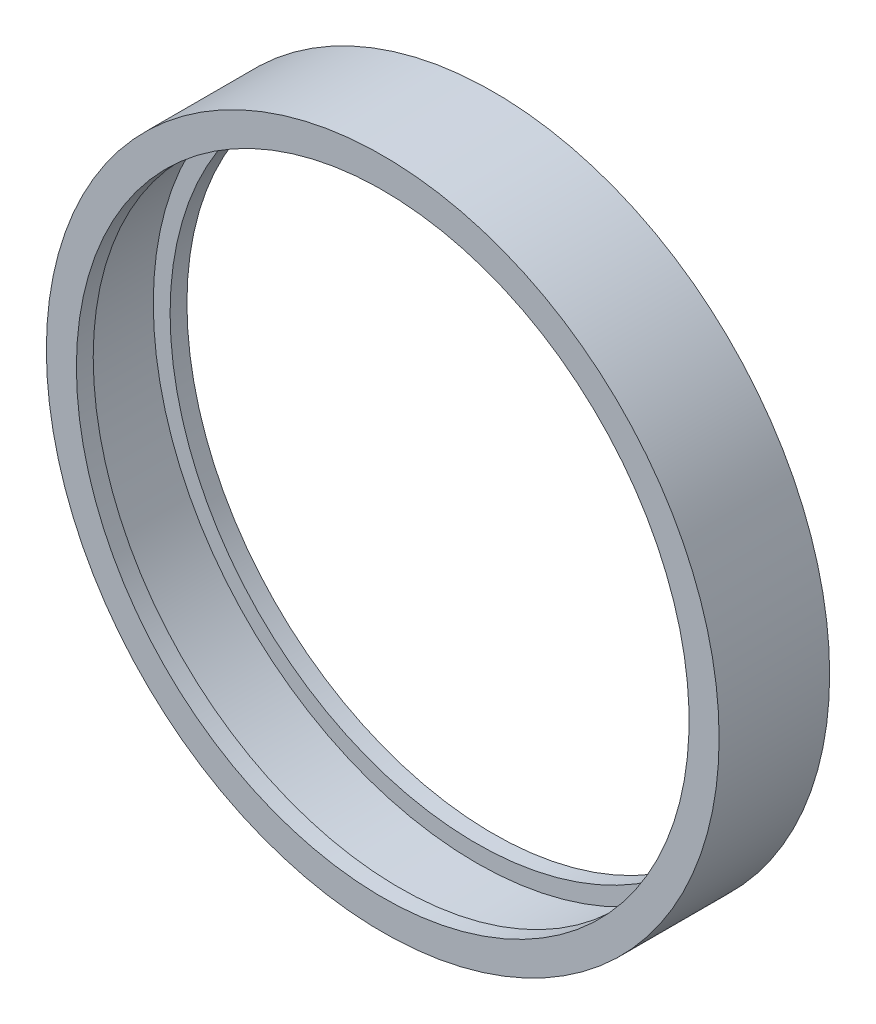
from build123d import *


with BuildPart() as part:
    # Sweep1: sweep along a path in Sketch1
    with BuildLine(Plane.XY) as sweep1_path:
        CenterArc((0, 0), 140, 0, 360)
    # Sketch2 → Sweep1 (sweep)
    with BuildSketch(Plane(origin=(-140, 0, 0), x_dir=(1, 0, 0), z_dir=(0, -1, 0))):
        Polygon((0, 0), (0, 23), (5.5, 23), (12.5, 23), (12.5, 16), (5.5, 16), (5.5, -16), (12.5, -16), (12.5, -23), (0, -23), align=None)
    sweep(path=sweep1_path.line)


solid = part.part
